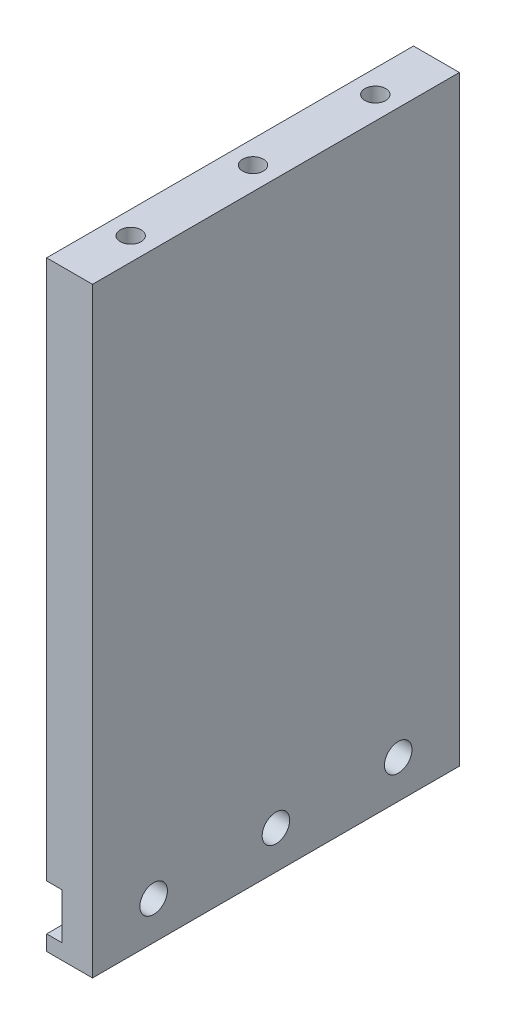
from build123d import *

# Parameters (mm, degrees)
EXTRUSION1_DEPTH           = 60
D_GAGEMENT_M81_D           = 9
TROU_TARAUD_M8X1_251_D     = 6.8
TROU_TARAUD_M8X1_251_DEPTH = 22.25
TROU_TARAUD_M8X1_251_TIP   = 2.042926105


with BuildPart() as part:
    # Esquisse1 → Extrusion1 (new, symmetric)
    with BuildSketch(Plane.XY):
        Polygon((-7.5, -96.5), (-7.5, -101.5), (7.5, -101.5), (7.5, 95), (-7.5, 95), (-7.5, -81.5), (-2.5, -81.5), (-2.5, -96.5), align=None)
    extrude(amount=EXTRUSION1_DEPTH, both=True)

    # D_gagement M81 (through all)
    with Locations(Plane(origin=(7.5, 0, 0), x_dir=(0, 0, -1), z_dir=(1, 0, 0))):
        with Locations((0, -89), (40, -89), (-40, -89)):
            Hole(D_GAGEMENT_M81_D / 2)

    # Trou taraud_ M8x1.251
    with Locations(Plane(origin=(0, 95, 0), x_dir=(-1, 0, 0), z_dir=(0, 1, 0))):
        with Locations((0, 0), (0, 40), (0, -40)):
            Hole(TROU_TARAUD_M8X1_251_D / 2, depth=TROU_TARAUD_M8X1_251_DEPTH)
            with Locations((0, 0, -(TROU_TARAUD_M8X1_251_DEPTH + TROU_TARAUD_M8X1_251_TIP / 2))):  # 118° drill point
                Cone(0, TROU_TARAUD_M8X1_251_D / 2, TROU_TARAUD_M8X1_251_TIP, mode=Mode.SUBTRACT)


solid = part.part
